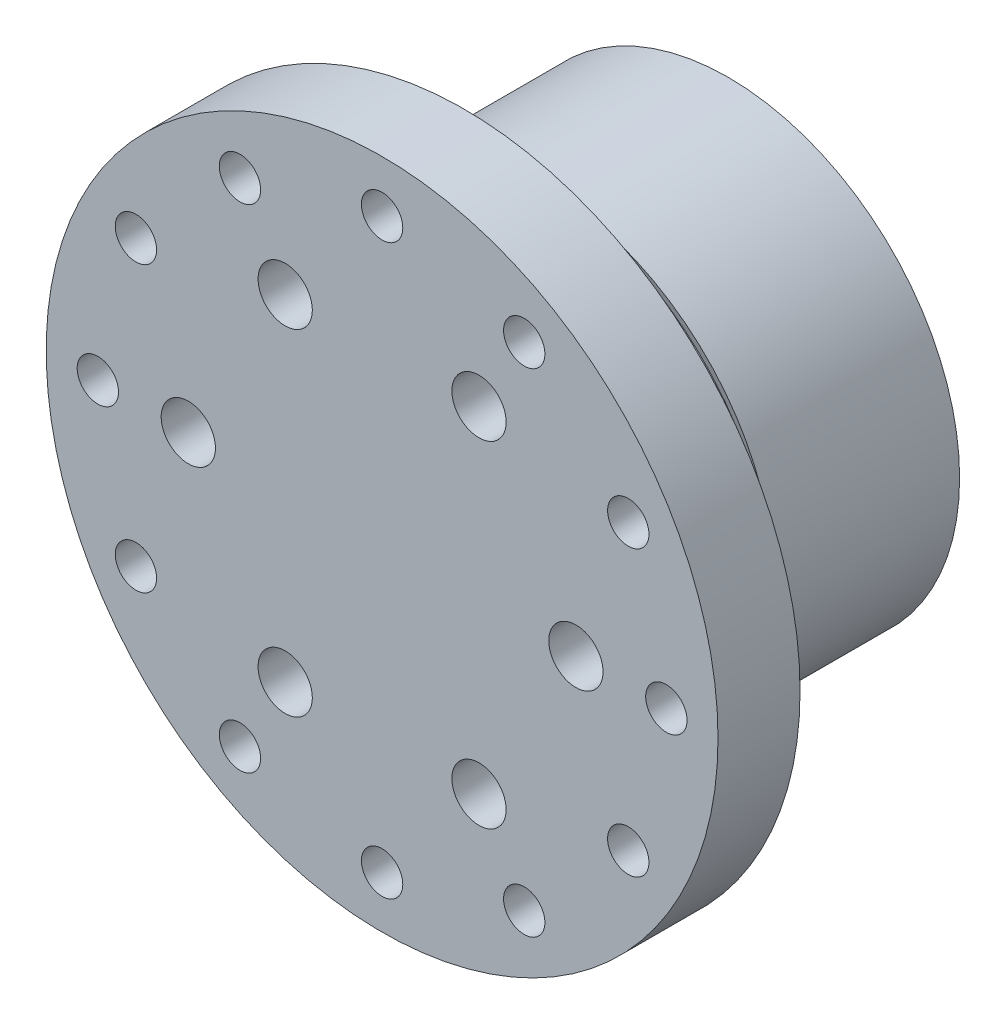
ISO-10303-21;
HEADER;
FILE_DESCRIPTION(('STEP AP214'),'2;1');
FILE_NAME('part.step','',(''),(''),'','','');
FILE_SCHEMA(('AUTOMOTIVE_DESIGN { 1 0 10303 214 1 1 1 1 }'));
ENDSEC;
DATA;
#1=APPLICATION_CONTEXT('core data for automotive mechanical design processes');
#2=APPLICATION_PROTOCOL_DEFINITION('international standard','automotive_design',2000,#1);
#3=PRODUCT_CONTEXT('',#1,'mechanical');
#4=PRODUCT('Part','Part','',(#3));
#5=PRODUCT_RELATED_PRODUCT_CATEGORY('part','',(#4));
#6=PRODUCT_DEFINITION_FORMATION('','',#4);
#7=PRODUCT_DEFINITION_CONTEXT('part definition',#1,'design');
#8=PRODUCT_DEFINITION('design','',#6,#7);
#9=PRODUCT_DEFINITION_SHAPE('','',#8);
#10=(LENGTH_UNIT() NAMED_UNIT(*) SI_UNIT(.MILLI.,.METRE.));
#11=(NAMED_UNIT(*) PLANE_ANGLE_UNIT() SI_UNIT($,.RADIAN.));
#12=(NAMED_UNIT(*) SI_UNIT($,.STERADIAN.) SOLID_ANGLE_UNIT());
#13=UNCERTAINTY_MEASURE_WITH_UNIT(LENGTH_MEASURE(1.E-05),#10,'distance_accuracy_value','');
#14=(GEOMETRIC_REPRESENTATION_CONTEXT(3) GLOBAL_UNCERTAINTY_ASSIGNED_CONTEXT((#13)) GLOBAL_UNIT_ASSIGNED_CONTEXT((#10,
#11,#12)) REPRESENTATION_CONTEXT('',''));
#15=CARTESIAN_POINT('',(0.,0.,0.));
#16=DIRECTION('',(0.,0.,1.));
#17=DIRECTION('',(1.,0.,0.));
#18=AXIS2_PLACEMENT_3D('',#15,#16,#17);
#19=CARTESIAN_POINT('',(0.,0.,0.));
#20=DIRECTION('',(0.,0.,1.));
#21=DIRECTION('',(1.,0.,0.));
#22=AXIS2_PLACEMENT_3D('',#19,#20,#21);
#23=PLANE('',#22);
#24=CARTESIAN_POINT('',(7.5,-12.9903810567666,0.));
#25=DIRECTION('',(0.,0.,1.));
#26=DIRECTION('',(1.,0.,0.));
#27=AXIS2_PLACEMENT_3D('',#24,#25,#26);
#28=CIRCLE('',#27,2.1);
#29=CARTESIAN_POINT('',(9.6,-12.9903810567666,0.));
#30=VERTEX_POINT('',#29);
#31=EDGE_CURVE('E152',#30,#30,#28,.T.);
#32=ORIENTED_EDGE('',*,*,#31,.T.);
#33=EDGE_LOOP('',(#32));
#34=FACE_BOUND('',#33,.T.);
#35=CARTESIAN_POINT('',(-7.5,-12.9903810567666,0.));
#36=DIRECTION('',(0.,0.,1.));
#37=DIRECTION('',(1.,0.,0.));
#38=AXIS2_PLACEMENT_3D('',#35,#36,#37);
#39=CIRCLE('',#38,2.1);
#40=CARTESIAN_POINT('',(-5.4,-12.9903810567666,0.));
#41=VERTEX_POINT('',#40);
#42=EDGE_CURVE('E162',#41,#41,#39,.T.);
#43=ORIENTED_EDGE('',*,*,#42,.T.);
#44=EDGE_LOOP('',(#43));
#45=FACE_BOUND('',#44,.T.);
#46=CARTESIAN_POINT('',(-15.,0.,0.));
#47=DIRECTION('',(0.,0.,1.));
#48=DIRECTION('',(1.,0.,0.));
#49=AXIS2_PLACEMENT_3D('',#46,#47,#48);
#50=CIRCLE('',#49,2.1);
#51=CARTESIAN_POINT('',(-12.9,0.,0.));
#52=VERTEX_POINT('',#51);
#53=EDGE_CURVE('E167',#52,#52,#50,.T.);
#54=ORIENTED_EDGE('',*,*,#53,.T.);
#55=EDGE_LOOP('',(#54));
#56=FACE_BOUND('',#55,.T.);
#57=CARTESIAN_POINT('',(-7.50000000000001,12.9903810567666,0.));
#58=DIRECTION('',(0.,0.,1.));
#59=DIRECTION('',(1.,0.,0.));
#60=AXIS2_PLACEMENT_3D('',#57,#58,#59);
#61=CIRCLE('',#60,2.1);
#62=CARTESIAN_POINT('',(-5.40000000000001,12.9903810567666,0.));
#63=VERTEX_POINT('',#62);
#64=EDGE_CURVE('E174',#63,#63,#61,.T.);
#65=ORIENTED_EDGE('',*,*,#64,.T.);
#66=EDGE_LOOP('',(#65));
#67=FACE_BOUND('',#66,.T.);
#68=CARTESIAN_POINT('',(7.5,12.9903810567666,0.));
#69=DIRECTION('',(0.,0.,1.));
#70=DIRECTION('',(1.,0.,0.));
#71=AXIS2_PLACEMENT_3D('',#68,#69,#70);
#72=CIRCLE('',#71,2.1);
#73=CARTESIAN_POINT('',(9.6,12.9903810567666,0.));
#74=VERTEX_POINT('',#73);
#75=EDGE_CURVE('E164',#74,#74,#72,.T.);
#76=ORIENTED_EDGE('',*,*,#75,.T.);
#77=EDGE_LOOP('',(#76));
#78=FACE_BOUND('',#77,.T.);
#79=CARTESIAN_POINT('',(15.,0.,0.));
#80=DIRECTION('',(0.,0.,1.));
#81=DIRECTION('',(1.,0.,0.));
#82=AXIS2_PLACEMENT_3D('',#79,#80,#81);
#83=CIRCLE('',#82,2.1);
#84=CARTESIAN_POINT('',(17.1,0.,0.));
#85=VERTEX_POINT('',#84);
#86=EDGE_CURVE('E149',#85,#85,#83,.T.);
#87=ORIENTED_EDGE('',*,*,#86,.T.);
#88=EDGE_LOOP('',(#87));
#89=FACE_BOUND('',#88,.T.);
#90=CARTESIAN_POINT('',(-12.3408620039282,-7.12500000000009,0.));
#91=DIRECTION('',(0.,0.,-1.));
#92=DIRECTION('',(-1.,0.,0.));
#93=AXIS2_PLACEMENT_3D('',#90,#91,#92);
#94=CIRCLE('',#93,3.);
#95=CARTESIAN_POINT('',(-15.3408620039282,-7.12500000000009,0.));
#96=VERTEX_POINT('',#95);
#97=EDGE_CURVE('E367',#96,#96,#94,.T.);
#98=ORIENTED_EDGE('',*,*,#97,.F.);
#99=EDGE_LOOP('',(#98));
#100=FACE_BOUND('',#99,.T.);
#101=CARTESIAN_POINT('',(0.,14.25,0.));
#102=DIRECTION('',(0.,0.,-1.));
#103=DIRECTION('',(-1.,0.,0.));
#104=AXIS2_PLACEMENT_3D('',#101,#102,#103);
#105=CIRCLE('',#104,3.);
#106=CARTESIAN_POINT('',(-3.00000000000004,14.25,0.));
#107=VERTEX_POINT('',#106);
#108=EDGE_CURVE('E382',#107,#107,#105,.T.);
#109=ORIENTED_EDGE('',*,*,#108,.F.);
#110=EDGE_LOOP('',(#109));
#111=FACE_BOUND('',#110,.T.);
#112=CARTESIAN_POINT('',(12.3408620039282,-7.12500000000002,0.));
#113=DIRECTION('',(0.,0.,-1.));
#114=DIRECTION('',(-1.,0.,0.));
#115=AXIS2_PLACEMENT_3D('',#112,#113,#114);
#116=CIRCLE('',#115,3.);
#117=CARTESIAN_POINT('',(9.34086200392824,-7.12500000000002,0.));
#118=VERTEX_POINT('',#117);
#119=EDGE_CURVE('E383',#118,#118,#116,.T.);
#120=ORIENTED_EDGE('',*,*,#119,.F.);
#121=EDGE_LOOP('',(#120));
#122=FACE_BOUND('',#121,.T.);
#123=CARTESIAN_POINT('',(0.,0.,0.));
#124=DIRECTION('',(0.,0.,-1.));
#125=DIRECTION('',(-1.,0.,0.));
#126=AXIS2_PLACEMENT_3D('',#123,#124,#125);
#127=CIRCLE('',#126,17.9);
#128=CARTESIAN_POINT('',(-17.9,0.,0.));
#129=VERTEX_POINT('',#128);
#130=EDGE_CURVE('E427',#129,#129,#127,.T.);
#131=ORIENTED_EDGE('',*,*,#130,.T.);
#132=EDGE_LOOP('',(#131));
#133=FACE_BOUND('',#132,.T.);
#134=ADVANCED_FACE('F48',(#34,#45,#56,#67,#78,#89,#100,#111,#122,#133),#23,.F.);
#135=CARTESIAN_POINT('',(0.,0.,20.45));
#136=DIRECTION('',(0.,0.,-1.));
#137=DIRECTION('',(-1.,0.,0.));
#138=AXIS2_PLACEMENT_3D('',#135,#136,#137);
#139=CYLINDRICAL_SURFACE('',#138,18.9);
#140=CARTESIAN_POINT('',(0.,0.,15.35));
#141=DIRECTION('',(0.,0.,1.));
#142=DIRECTION('',(1.,0.,0.));
#143=AXIS2_PLACEMENT_3D('',#140,#141,#142);
#144=CIRCLE('',#143,18.9);
#145=CARTESIAN_POINT('',(18.9,0.,15.35));
#146=VERTEX_POINT('',#145);
#147=EDGE_CURVE('E440',#146,#146,#144,.F.);
#148=ORIENTED_EDGE('',*,*,#147,.F.);
#149=EDGE_LOOP('',(#148));
#150=FACE_BOUND('',#149,.T.);
#151=CARTESIAN_POINT('',(0.,0.,20.45));
#152=DIRECTION('',(0.,0.,1.));
#153=DIRECTION('',(1.,0.,0.));
#154=AXIS2_PLACEMENT_3D('',#151,#152,#153);
#155=CIRCLE('',#154,18.9);
#156=CARTESIAN_POINT('',(18.9,0.,20.45));
#157=VERTEX_POINT('',#156);
#158=EDGE_CURVE('E60',#157,#157,#155,.T.);
#159=ORIENTED_EDGE('',*,*,#158,.F.);
#160=EDGE_LOOP('',(#159));
#161=FACE_BOUND('',#160,.T.);
#162=ADVANCED_FACE('F270',(#150,#161),#139,.T.);
#163=CARTESIAN_POINT('',(0.,0.,26.8));
#164=DIRECTION('',(0.,0.,-1.));
#165=DIRECTION('',(-1.,0.,0.));
#166=AXIS2_PLACEMENT_3D('',#163,#164,#165);
#167=CYLINDRICAL_SURFACE('',#166,26.);
#168=CARTESIAN_POINT('',(0.,0.,26.8));
#169=DIRECTION('',(0.,0.,1.));
#170=DIRECTION('',(1.,0.,0.));
#171=AXIS2_PLACEMENT_3D('',#168,#169,#170);
#172=CIRCLE('',#171,26.);
#173=CARTESIAN_POINT('',(26.,0.,26.8));
#174=VERTEX_POINT('',#173);
#175=EDGE_CURVE('E61',#174,#174,#172,.T.);
#176=ORIENTED_EDGE('',*,*,#175,.F.);
#177=EDGE_LOOP('',(#176));
#178=FACE_BOUND('',#177,.T.);
#179=CARTESIAN_POINT('',(0.,0.,20.45));
#180=DIRECTION('',(0.,0.,1.));
#181=DIRECTION('',(1.,0.,0.));
#182=AXIS2_PLACEMENT_3D('',#179,#180,#181);
#183=CIRCLE('',#182,26.);
#184=CARTESIAN_POINT('',(26.,0.,20.45));
#185=VERTEX_POINT('',#184);
#186=EDGE_CURVE('E70',#185,#185,#183,.T.);
#187=ORIENTED_EDGE('',*,*,#186,.T.);
#188=EDGE_LOOP('',(#187));
#189=FACE_BOUND('',#188,.T.);
#190=ADVANCED_FACE('F91',(#178,#189),#167,.T.);
#191=CARTESIAN_POINT('',(0.,0.,26.8));
#192=DIRECTION('',(0.,0.,1.));
#193=DIRECTION('',(1.,0.,0.));
#194=AXIS2_PLACEMENT_3D('',#191,#192,#193);
#195=PLANE('',#194);
#196=CARTESIAN_POINT('',(-10.9999999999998,19.0525588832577,26.8));
#197=DIRECTION('',(0.,0.,1.));
#198=DIRECTION('',(1.,0.,0.));
#199=AXIS2_PLACEMENT_3D('',#196,#197,#198);
#200=CIRCLE('',#199,1.6);
#201=CARTESIAN_POINT('',(-9.39999999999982,19.0525588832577,26.8));
#202=VERTEX_POINT('',#201);
#203=EDGE_CURVE('E408',#202,#202,#200,.T.);
#204=ORIENTED_EDGE('',*,*,#203,.F.);
#205=EDGE_LOOP('',(#204));
#206=FACE_BOUND('',#205,.T.);
#207=CARTESIAN_POINT('',(-19.0525588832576,11.0000000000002,26.8));
#208=DIRECTION('',(0.,0.,1.));
#209=DIRECTION('',(1.,0.,0.));
#210=AXIS2_PLACEMENT_3D('',#207,#208,#209);
#211=CIRCLE('',#210,1.6);
#212=CARTESIAN_POINT('',(-17.4525588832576,11.0000000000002,26.8));
#213=VERTEX_POINT('',#212);
#214=EDGE_CURVE('E415',#213,#213,#211,.T.);
#215=ORIENTED_EDGE('',*,*,#214,.F.);
#216=EDGE_LOOP('',(#215));
#217=FACE_BOUND('',#216,.T.);
#218=CARTESIAN_POINT('',(-22.,1.53625178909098E-13,26.8));
#219=DIRECTION('',(0.,0.,1.));
#220=DIRECTION('',(1.,0.,0.));
#221=AXIS2_PLACEMENT_3D('',#218,#219,#220);
#222=CIRCLE('',#221,1.6);
#223=CARTESIAN_POINT('',(-20.4,1.53625178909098E-13,26.8));
#224=VERTEX_POINT('',#223);
#225=EDGE_CURVE('E420',#224,#224,#222,.T.);
#226=ORIENTED_EDGE('',*,*,#225,.F.);
#227=EDGE_LOOP('',(#226));
#228=FACE_BOUND('',#227,.T.);
#229=CARTESIAN_POINT('',(-19.0525588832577,-10.9999999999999,26.8));
#230=DIRECTION('',(0.,0.,1.));
#231=DIRECTION('',(1.,0.,0.));
#232=AXIS2_PLACEMENT_3D('',#229,#230,#231);
#233=CIRCLE('',#232,1.6);
#234=CARTESIAN_POINT('',(-17.4525588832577,-10.9999999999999,26.8));
#235=VERTEX_POINT('',#234);
#236=EDGE_CURVE('E400',#235,#235,#233,.T.);
#237=ORIENTED_EDGE('',*,*,#236,.F.);
#238=EDGE_LOOP('',(#237));
#239=FACE_BOUND('',#238,.T.);
#240=CARTESIAN_POINT('',(-11.0000000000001,-19.0525588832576,26.8));
#241=DIRECTION('',(0.,0.,1.));
#242=DIRECTION('',(1.,0.,0.));
#243=AXIS2_PLACEMENT_3D('',#240,#241,#242);
#244=CIRCLE('',#243,1.6);
#245=CARTESIAN_POINT('',(-9.40000000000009,-19.0525588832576,26.8));
#246=VERTEX_POINT('',#245);
#247=EDGE_CURVE('E395',#246,#246,#244,.T.);
#248=ORIENTED_EDGE('',*,*,#247,.F.);
#249=EDGE_LOOP('',(#248));
#250=FACE_BOUND('',#249,.T.);
#251=CARTESIAN_POINT('',(0.,-22.,26.8));
#252=DIRECTION('',(0.,0.,1.));
#253=DIRECTION('',(1.,0.,0.));
#254=AXIS2_PLACEMENT_3D('',#251,#252,#253);
#255=CIRCLE('',#254,1.6);
#256=CARTESIAN_POINT('',(1.59999999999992,-22.,26.8));
#257=VERTEX_POINT('',#256);
#258=EDGE_CURVE('E399',#257,#257,#255,.T.);
#259=ORIENTED_EDGE('',*,*,#258,.F.);
#260=EDGE_LOOP('',(#259));
#261=FACE_BOUND('',#260,.T.);
#262=CARTESIAN_POINT('',(11.,-19.0525588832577,26.8));
#263=DIRECTION('',(0.,0.,1.));
#264=DIRECTION('',(1.,0.,0.));
#265=AXIS2_PLACEMENT_3D('',#262,#263,#264);
#266=CIRCLE('',#265,1.6);
#267=CARTESIAN_POINT('',(12.6,-19.0525588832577,26.8));
#268=VERTEX_POINT('',#267);
#269=EDGE_CURVE('E405',#268,#268,#266,.T.);
#270=ORIENTED_EDGE('',*,*,#269,.F.);
#271=EDGE_LOOP('',(#270));
#272=FACE_BOUND('',#271,.T.);
#273=CARTESIAN_POINT('',(19.0525588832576,-11.,26.8));
#274=DIRECTION('',(0.,0.,1.));
#275=DIRECTION('',(1.,0.,0.));
#276=AXIS2_PLACEMENT_3D('',#273,#274,#275);
#277=CIRCLE('',#276,1.6);
#278=CARTESIAN_POINT('',(20.6525588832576,-11.,26.8));
#279=VERTEX_POINT('',#278);
#280=EDGE_CURVE('E342',#279,#279,#277,.T.);
#281=ORIENTED_EDGE('',*,*,#280,.F.);
#282=EDGE_LOOP('',(#281));
#283=FACE_BOUND('',#282,.T.);
#284=CARTESIAN_POINT('',(2.30437768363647E-13,22.,26.8));
#285=DIRECTION('',(0.,0.,1.));
#286=DIRECTION('',(1.,0.,0.));
#287=AXIS2_PLACEMENT_3D('',#284,#285,#286);
#288=CIRCLE('',#287,1.6);
#289=CARTESIAN_POINT('',(1.60000000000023,22.,26.8));
#290=VERTEX_POINT('',#289);
#291=EDGE_CURVE('E411',#290,#290,#288,.T.);
#292=ORIENTED_EDGE('',*,*,#291,.F.);
#293=EDGE_LOOP('',(#292));
#294=FACE_BOUND('',#293,.T.);
#295=CARTESIAN_POINT('',(11.0000000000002,19.0525588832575,26.8));
#296=DIRECTION('',(0.,0.,1.));
#297=DIRECTION('',(1.,0.,0.));
#298=AXIS2_PLACEMENT_3D('',#295,#296,#297);
#299=CIRCLE('',#298,1.6);
#300=CARTESIAN_POINT('',(12.6000000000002,19.0525588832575,26.8));
#301=VERTEX_POINT('',#300);
#302=EDGE_CURVE('E429',#301,#301,#299,.T.);
#303=ORIENTED_EDGE('',*,*,#302,.F.);
#304=EDGE_LOOP('',(#303));
#305=FACE_BOUND('',#304,.T.);
#306=CARTESIAN_POINT('',(19.0525588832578,10.9999999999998,26.8));
#307=DIRECTION('',(0.,0.,1.));
#308=DIRECTION('',(1.,0.,0.));
#309=AXIS2_PLACEMENT_3D('',#306,#307,#308);
#310=CIRCLE('',#309,1.6);
#311=CARTESIAN_POINT('',(20.6525588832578,10.9999999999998,26.8));
#312=VERTEX_POINT('',#311);
#313=EDGE_CURVE('E424',#312,#312,#310,.T.);
#314=ORIENTED_EDGE('',*,*,#313,.F.);
#315=EDGE_LOOP('',(#314));
#316=FACE_BOUND('',#315,.T.);
#317=CARTESIAN_POINT('',(22.,0.,26.8));
#318=DIRECTION('',(0.,0.,1.));
#319=DIRECTION('',(1.,0.,0.));
#320=AXIS2_PLACEMENT_3D('',#317,#318,#319);
#321=CIRCLE('',#320,1.6);
#322=CARTESIAN_POINT('',(23.6,0.,26.8));
#323=VERTEX_POINT('',#322);
#324=EDGE_CURVE('E338',#323,#323,#321,.T.);
#325=ORIENTED_EDGE('',*,*,#324,.F.);
#326=EDGE_LOOP('',(#325));
#327=FACE_BOUND('',#326,.T.);
#328=CARTESIAN_POINT('',(15.,0.,26.800012));
#329=DIRECTION('',(0.,0.,1.));
#330=DIRECTION('',(1.,0.,0.));
#331=AXIS2_PLACEMENT_3D('',#328,#329,#330);
#332=CIRCLE('',#331,2.1);
#333=CARTESIAN_POINT('',(17.1,0.,26.800012));
#334=VERTEX_POINT('',#333);
#335=EDGE_CURVE('E145',#334,#334,#332,.T.);
#336=ORIENTED_EDGE('',*,*,#335,.F.);
#337=EDGE_LOOP('',(#336));
#338=FACE_BOUND('',#337,.T.);
#339=CARTESIAN_POINT('',(7.5,12.9903810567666,26.800012));
#340=DIRECTION('',(0.,0.,1.));
#341=DIRECTION('',(1.,0.,0.));
#342=AXIS2_PLACEMENT_3D('',#339,#340,#341);
#343=CIRCLE('',#342,2.1);
#344=CARTESIAN_POINT('',(9.6,12.9903810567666,26.800012));
#345=VERTEX_POINT('',#344);
#346=EDGE_CURVE('E132',#345,#345,#343,.T.);
#347=ORIENTED_EDGE('',*,*,#346,.F.);
#348=EDGE_LOOP('',(#347));
#349=FACE_BOUND('',#348,.T.);
#350=CARTESIAN_POINT('',(-7.50000000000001,12.9903810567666,26.800012));
#351=DIRECTION('',(0.,0.,1.));
#352=DIRECTION('',(1.,0.,0.));
#353=AXIS2_PLACEMENT_3D('',#350,#351,#352);
#354=CIRCLE('',#353,2.1);
#355=CARTESIAN_POINT('',(-5.40000000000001,12.9903810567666,26.800012));
#356=VERTEX_POINT('',#355);
#357=EDGE_CURVE('E172',#356,#356,#354,.T.);
#358=ORIENTED_EDGE('',*,*,#357,.F.);
#359=EDGE_LOOP('',(#358));
#360=FACE_BOUND('',#359,.T.);
#361=CARTESIAN_POINT('',(-15.,0.,26.800012));
#362=DIRECTION('',(0.,0.,1.));
#363=DIRECTION('',(1.,0.,0.));
#364=AXIS2_PLACEMENT_3D('',#361,#362,#363);
#365=CIRCLE('',#364,2.1);
#366=CARTESIAN_POINT('',(-12.9,0.,26.800012));
#367=VERTEX_POINT('',#366);
#368=EDGE_CURVE('E169',#367,#367,#365,.T.);
#369=ORIENTED_EDGE('',*,*,#368,.F.);
#370=EDGE_LOOP('',(#369));
#371=FACE_BOUND('',#370,.T.);
#372=CARTESIAN_POINT('',(-7.5,-12.9903810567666,26.800012));
#373=DIRECTION('',(0.,0.,1.));
#374=DIRECTION('',(1.,0.,0.));
#375=AXIS2_PLACEMENT_3D('',#372,#373,#374);
#376=CIRCLE('',#375,2.1);
#377=CARTESIAN_POINT('',(-5.4,-12.9903810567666,26.800012));
#378=VERTEX_POINT('',#377);
#379=EDGE_CURVE('E157',#378,#378,#376,.T.);
#380=ORIENTED_EDGE('',*,*,#379,.F.);
#381=EDGE_LOOP('',(#380));
#382=FACE_BOUND('',#381,.T.);
#383=CARTESIAN_POINT('',(7.5,-12.9903810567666,26.800012));
#384=DIRECTION('',(0.,0.,1.));
#385=DIRECTION('',(1.,0.,0.));
#386=AXIS2_PLACEMENT_3D('',#383,#384,#385);
#387=CIRCLE('',#386,2.1);
#388=CARTESIAN_POINT('',(9.6,-12.9903810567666,26.800012));
#389=VERTEX_POINT('',#388);
#390=EDGE_CURVE('E77',#389,#389,#387,.T.);
#391=ORIENTED_EDGE('',*,*,#390,.F.);
#392=EDGE_LOOP('',(#391));
#393=FACE_BOUND('',#392,.T.);
#394=ORIENTED_EDGE('',*,*,#175,.T.);
#395=EDGE_LOOP('',(#394));
#396=FACE_BOUND('',#395,.T.);
#397=ADVANCED_FACE('F85',(#206,#217,#228,#239,#250,#261,#272,#283,#294,#305,#316,#327,#338,#349,
#360,#371,#382,#393,#396),#195,.T.);
#398=CARTESIAN_POINT('',(0.,0.,20.45));
#399=DIRECTION('',(0.,0.,1.));
#400=DIRECTION('',(1.,0.,0.));
#401=AXIS2_PLACEMENT_3D('',#398,#399,#400);
#402=PLANE('',#401);
#403=CARTESIAN_POINT('',(-10.9999999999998,19.0525588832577,20.45));
#404=DIRECTION('',(0.,0.,1.));
#405=DIRECTION('',(1.,0.,0.));
#406=AXIS2_PLACEMENT_3D('',#403,#404,#405);
#407=CIRCLE('',#406,1.6);
#408=CARTESIAN_POINT('',(-9.39999999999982,19.0525588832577,20.45));
#409=VERTEX_POINT('',#408);
#410=EDGE_CURVE('E295',#409,#409,#407,.T.);
#411=ORIENTED_EDGE('',*,*,#410,.T.);
#412=EDGE_LOOP('',(#411));
#413=FACE_BOUND('',#412,.T.);
#414=CARTESIAN_POINT('',(-19.0525588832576,11.0000000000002,20.45));
#415=DIRECTION('',(0.,0.,1.));
#416=DIRECTION('',(1.,0.,0.));
#417=AXIS2_PLACEMENT_3D('',#414,#415,#416);
#418=CIRCLE('',#417,1.6);
#419=CARTESIAN_POINT('',(-17.4525588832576,11.0000000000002,20.45));
#420=VERTEX_POINT('',#419);
#421=EDGE_CURVE('E296',#420,#420,#418,.T.);
#422=ORIENTED_EDGE('',*,*,#421,.T.);
#423=EDGE_LOOP('',(#422));
#424=FACE_BOUND('',#423,.T.);
#425=CARTESIAN_POINT('',(-22.,1.53625178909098E-13,20.45));
#426=DIRECTION('',(0.,0.,1.));
#427=DIRECTION('',(1.,0.,0.));
#428=AXIS2_PLACEMENT_3D('',#425,#426,#427);
#429=CIRCLE('',#428,1.6);
#430=CARTESIAN_POINT('',(-20.4,1.53625178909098E-13,20.45));
#431=VERTEX_POINT('',#430);
#432=EDGE_CURVE('E305',#431,#431,#429,.T.);
#433=ORIENTED_EDGE('',*,*,#432,.T.);
#434=EDGE_LOOP('',(#433));
#435=FACE_BOUND('',#434,.T.);
#436=CARTESIAN_POINT('',(-19.0525588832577,-10.9999999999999,20.45));
#437=DIRECTION('',(0.,0.,1.));
#438=DIRECTION('',(1.,0.,0.));
#439=AXIS2_PLACEMENT_3D('',#436,#437,#438);
#440=CIRCLE('',#439,1.6);
#441=CARTESIAN_POINT('',(-17.4525588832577,-10.9999999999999,20.45));
#442=VERTEX_POINT('',#441);
#443=EDGE_CURVE('E306',#442,#442,#440,.T.);
#444=ORIENTED_EDGE('',*,*,#443,.T.);
#445=EDGE_LOOP('',(#444));
#446=FACE_BOUND('',#445,.T.);
#447=CARTESIAN_POINT('',(-11.0000000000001,-19.0525588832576,20.45));
#448=DIRECTION('',(0.,0.,1.));
#449=DIRECTION('',(1.,0.,0.));
#450=AXIS2_PLACEMENT_3D('',#447,#448,#449);
#451=CIRCLE('',#450,1.6);
#452=CARTESIAN_POINT('',(-9.40000000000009,-19.0525588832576,20.45));
#453=VERTEX_POINT('',#452);
#454=EDGE_CURVE('E309',#453,#453,#451,.T.);
#455=ORIENTED_EDGE('',*,*,#454,.T.);
#456=EDGE_LOOP('',(#455));
#457=FACE_BOUND('',#456,.T.);
#458=CARTESIAN_POINT('',(0.,-22.,20.45));
#459=DIRECTION('',(0.,0.,1.));
#460=DIRECTION('',(1.,0.,0.));
#461=AXIS2_PLACEMENT_3D('',#458,#459,#460);
#462=CIRCLE('',#461,1.6);
#463=CARTESIAN_POINT('',(1.59999999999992,-22.,20.45));
#464=VERTEX_POINT('',#463);
#465=EDGE_CURVE('E313',#464,#464,#462,.T.);
#466=ORIENTED_EDGE('',*,*,#465,.T.);
#467=EDGE_LOOP('',(#466));
#468=FACE_BOUND('',#467,.T.);
#469=CARTESIAN_POINT('',(11.,-19.0525588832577,20.45));
#470=DIRECTION('',(0.,0.,1.));
#471=DIRECTION('',(1.,0.,0.));
#472=AXIS2_PLACEMENT_3D('',#469,#470,#471);
#473=CIRCLE('',#472,1.6);
#474=CARTESIAN_POINT('',(12.6,-19.0525588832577,20.45));
#475=VERTEX_POINT('',#474);
#476=EDGE_CURVE('E319',#475,#475,#473,.T.);
#477=ORIENTED_EDGE('',*,*,#476,.T.);
#478=EDGE_LOOP('',(#477));
#479=FACE_BOUND('',#478,.T.);
#480=CARTESIAN_POINT('',(19.0525588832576,-11.,20.45));
#481=DIRECTION('',(0.,0.,1.));
#482=DIRECTION('',(1.,0.,0.));
#483=AXIS2_PLACEMENT_3D('',#480,#481,#482);
#484=CIRCLE('',#483,1.6);
#485=CARTESIAN_POINT('',(20.6525588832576,-11.,20.45));
#486=VERTEX_POINT('',#485);
#487=EDGE_CURVE('E321',#486,#486,#484,.T.);
#488=ORIENTED_EDGE('',*,*,#487,.T.);
#489=EDGE_LOOP('',(#488));
#490=FACE_BOUND('',#489,.T.);
#491=CARTESIAN_POINT('',(2.30437768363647E-13,22.,20.45));
#492=DIRECTION('',(0.,0.,1.));
#493=DIRECTION('',(1.,0.,0.));
#494=AXIS2_PLACEMENT_3D('',#491,#492,#493);
#495=CIRCLE('',#494,1.6);
#496=CARTESIAN_POINT('',(1.60000000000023,22.,20.45));
#497=VERTEX_POINT('',#496);
#498=EDGE_CURVE('E327',#497,#497,#495,.T.);
#499=ORIENTED_EDGE('',*,*,#498,.T.);
#500=EDGE_LOOP('',(#499));
#501=FACE_BOUND('',#500,.T.);
#502=CARTESIAN_POINT('',(11.0000000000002,19.0525588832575,20.45));
#503=DIRECTION('',(0.,0.,1.));
#504=DIRECTION('',(1.,0.,0.));
#505=AXIS2_PLACEMENT_3D('',#502,#503,#504);
#506=CIRCLE('',#505,1.6);
#507=CARTESIAN_POINT('',(12.6000000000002,19.0525588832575,20.45));
#508=VERTEX_POINT('',#507);
#509=EDGE_CURVE('E328',#508,#508,#506,.T.);
#510=ORIENTED_EDGE('',*,*,#509,.T.);
#511=EDGE_LOOP('',(#510));
#512=FACE_BOUND('',#511,.T.);
#513=CARTESIAN_POINT('',(19.0525588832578,10.9999999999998,20.45));
#514=DIRECTION('',(0.,0.,1.));
#515=DIRECTION('',(1.,0.,0.));
#516=AXIS2_PLACEMENT_3D('',#513,#514,#515);
#517=CIRCLE('',#516,1.6);
#518=CARTESIAN_POINT('',(20.6525588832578,10.9999999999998,20.45));
#519=VERTEX_POINT('',#518);
#520=EDGE_CURVE('E331',#519,#519,#517,.T.);
#521=ORIENTED_EDGE('',*,*,#520,.T.);
#522=EDGE_LOOP('',(#521));
#523=FACE_BOUND('',#522,.T.);
#524=CARTESIAN_POINT('',(22.,0.,20.45));
#525=DIRECTION('',(0.,0.,1.));
#526=DIRECTION('',(1.,0.,0.));
#527=AXIS2_PLACEMENT_3D('',#524,#525,#526);
#528=CIRCLE('',#527,1.6);
#529=CARTESIAN_POINT('',(23.6,0.,20.45));
#530=VERTEX_POINT('',#529);
#531=EDGE_CURVE('E340',#530,#530,#528,.T.);
#532=ORIENTED_EDGE('',*,*,#531,.T.);
#533=EDGE_LOOP('',(#532));
#534=FACE_BOUND('',#533,.T.);
#535=ORIENTED_EDGE('',*,*,#158,.T.);
#536=EDGE_LOOP('',(#535));
#537=FACE_BOUND('',#536,.T.);
#538=ORIENTED_EDGE('',*,*,#186,.F.);
#539=EDGE_LOOP('',(#538));
#540=FACE_BOUND('',#539,.T.);
#541=ADVANCED_FACE('F95',(#413,#424,#435,#446,#457,#468,#479,#490,#501,#512,#523,#534,#537,
#540),#402,.F.);
#542=CARTESIAN_POINT('',(7.5,-12.9903810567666,0.));
#543=DIRECTION('',(0.,0.,1.));
#544=DIRECTION('',(1.,0.,0.));
#545=AXIS2_PLACEMENT_3D('',#542,#543,#544);
#546=CYLINDRICAL_SURFACE('',#545,2.1);
#547=ORIENTED_EDGE('',*,*,#31,.F.);
#548=EDGE_LOOP('',(#547));
#549=FACE_BOUND('',#548,.T.);
#550=ORIENTED_EDGE('',*,*,#390,.T.);
#551=EDGE_LOOP('',(#550));
#552=FACE_BOUND('',#551,.T.);
#553=ADVANCED_FACE('F205',(#549,#552),#546,.F.);
#554=CARTESIAN_POINT('',(-7.5,-12.9903810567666,0.));
#555=DIRECTION('',(0.,0.,1.));
#556=DIRECTION('',(1.,0.,0.));
#557=AXIS2_PLACEMENT_3D('',#554,#555,#556);
#558=CYLINDRICAL_SURFACE('',#557,2.1);
#559=ORIENTED_EDGE('',*,*,#42,.F.);
#560=EDGE_LOOP('',(#559));
#561=FACE_BOUND('',#560,.T.);
#562=ORIENTED_EDGE('',*,*,#379,.T.);
#563=EDGE_LOOP('',(#562));
#564=FACE_BOUND('',#563,.T.);
#565=ADVANCED_FACE('F241',(#561,#564),#558,.F.);
#566=CARTESIAN_POINT('',(-15.,0.,0.));
#567=DIRECTION('',(0.,0.,1.));
#568=DIRECTION('',(1.,0.,0.));
#569=AXIS2_PLACEMENT_3D('',#566,#567,#568);
#570=CYLINDRICAL_SURFACE('',#569,2.1);
#571=ORIENTED_EDGE('',*,*,#53,.F.);
#572=EDGE_LOOP('',(#571));
#573=FACE_BOUND('',#572,.T.);
#574=ORIENTED_EDGE('',*,*,#368,.T.);
#575=EDGE_LOOP('',(#574));
#576=FACE_BOUND('',#575,.T.);
#577=ADVANCED_FACE('F231',(#573,#576),#570,.F.);
#578=CARTESIAN_POINT('',(-7.50000000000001,12.9903810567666,0.));
#579=DIRECTION('',(0.,0.,1.));
#580=DIRECTION('',(1.,0.,0.));
#581=AXIS2_PLACEMENT_3D('',#578,#579,#580);
#582=CYLINDRICAL_SURFACE('',#581,2.1);
#583=ORIENTED_EDGE('',*,*,#64,.F.);
#584=EDGE_LOOP('',(#583));
#585=FACE_BOUND('',#584,.T.);
#586=ORIENTED_EDGE('',*,*,#357,.T.);
#587=EDGE_LOOP('',(#586));
#588=FACE_BOUND('',#587,.T.);
#589=ADVANCED_FACE('F98',(#585,#588),#582,.F.);
#590=CARTESIAN_POINT('',(7.5,12.9903810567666,0.));
#591=DIRECTION('',(0.,0.,1.));
#592=DIRECTION('',(1.,0.,0.));
#593=AXIS2_PLACEMENT_3D('',#590,#591,#592);
#594=CYLINDRICAL_SURFACE('',#593,2.1);
#595=ORIENTED_EDGE('',*,*,#75,.F.);
#596=EDGE_LOOP('',(#595));
#597=FACE_BOUND('',#596,.T.);
#598=ORIENTED_EDGE('',*,*,#346,.T.);
#599=EDGE_LOOP('',(#598));
#600=FACE_BOUND('',#599,.T.);
#601=ADVANCED_FACE('F192',(#597,#600),#594,.F.);
#602=CARTESIAN_POINT('',(15.,0.,0.));
#603=DIRECTION('',(0.,0.,1.));
#604=DIRECTION('',(1.,0.,0.));
#605=AXIS2_PLACEMENT_3D('',#602,#603,#604);
#606=CYLINDRICAL_SURFACE('',#605,2.1);
#607=ORIENTED_EDGE('',*,*,#86,.F.);
#608=EDGE_LOOP('',(#607));
#609=FACE_BOUND('',#608,.T.);
#610=ORIENTED_EDGE('',*,*,#335,.T.);
#611=EDGE_LOOP('',(#610));
#612=FACE_BOUND('',#611,.T.);
#613=ADVANCED_FACE('F183',(#609,#612),#606,.F.);
#614=CARTESIAN_POINT('',(-12.3408620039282,-7.12500000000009,4.));
#615=DIRECTION('',(0.,0.,-1.));
#616=DIRECTION('',(-1.,0.,0.));
#617=AXIS2_PLACEMENT_3D('',#614,#615,#616);
#618=CYLINDRICAL_SURFACE('',#617,3.);
#619=CARTESIAN_POINT('',(-12.3408620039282,-7.12500000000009,4.));
#620=DIRECTION('',(0.,0.,-1.));
#621=DIRECTION('',(-1.,0.,0.));
#622=AXIS2_PLACEMENT_3D('',#619,#620,#621);
#623=CIRCLE('',#622,3.);
#624=CARTESIAN_POINT('',(-15.3408620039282,-7.12500000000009,4.));
#625=VERTEX_POINT('',#624);
#626=EDGE_CURVE('E366',#625,#625,#623,.T.);
#627=ORIENTED_EDGE('',*,*,#626,.F.);
#628=EDGE_LOOP('',(#627));
#629=FACE_BOUND('',#628,.T.);
#630=ORIENTED_EDGE('',*,*,#97,.T.);
#631=EDGE_LOOP('',(#630));
#632=FACE_BOUND('',#631,.T.);
#633=ADVANCED_FACE('F193',(#629,#632),#618,.F.);
#634=CARTESIAN_POINT('',(-12.3408620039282,-7.12500000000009,4.));
#635=DIRECTION('',(0.,0.,-1.));
#636=DIRECTION('',(-1.,0.,0.));
#637=AXIS2_PLACEMENT_3D('',#634,#635,#636);
#638=PLANE('',#637);
#639=ORIENTED_EDGE('',*,*,#626,.T.);
#640=EDGE_LOOP('',(#639));
#641=FACE_BOUND('',#640,.T.);
#642=ADVANCED_FACE('F199',(#641),#638,.T.);
#643=CARTESIAN_POINT('',(0.,14.25,4.));
#644=DIRECTION('',(0.,0.,-1.));
#645=DIRECTION('',(-1.,0.,0.));
#646=AXIS2_PLACEMENT_3D('',#643,#644,#645);
#647=CYLINDRICAL_SURFACE('',#646,3.);
#648=CARTESIAN_POINT('',(0.,14.25,4.));
#649=DIRECTION('',(0.,0.,-1.));
#650=DIRECTION('',(-1.,0.,0.));
#651=AXIS2_PLACEMENT_3D('',#648,#649,#650);
#652=CIRCLE('',#651,3.);
#653=CARTESIAN_POINT('',(-3.00000000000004,14.25,4.));
#654=VERTEX_POINT('',#653);
#655=EDGE_CURVE('E374',#654,#654,#652,.T.);
#656=ORIENTED_EDGE('',*,*,#655,.F.);
#657=EDGE_LOOP('',(#656));
#658=FACE_BOUND('',#657,.T.);
#659=ORIENTED_EDGE('',*,*,#108,.T.);
#660=EDGE_LOOP('',(#659));
#661=FACE_BOUND('',#660,.T.);
#662=ADVANCED_FACE('F508',(#658,#661),#647,.F.);
#663=CARTESIAN_POINT('',(0.,14.25,4.));
#664=DIRECTION('',(0.,0.,-1.));
#665=DIRECTION('',(-1.,0.,0.));
#666=AXIS2_PLACEMENT_3D('',#663,#664,#665);
#667=PLANE('',#666);
#668=ORIENTED_EDGE('',*,*,#655,.T.);
#669=EDGE_LOOP('',(#668));
#670=FACE_BOUND('',#669,.T.);
#671=ADVANCED_FACE('F510',(#670),#667,.T.);
#672=CARTESIAN_POINT('',(12.3408620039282,-7.12500000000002,4.));
#673=DIRECTION('',(0.,0.,-1.));
#674=DIRECTION('',(-1.,0.,0.));
#675=AXIS2_PLACEMENT_3D('',#672,#673,#674);
#676=CYLINDRICAL_SURFACE('',#675,3.);
#677=CARTESIAN_POINT('',(12.3408620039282,-7.12500000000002,4.));
#678=DIRECTION('',(0.,0.,-1.));
#679=DIRECTION('',(-1.,0.,0.));
#680=AXIS2_PLACEMENT_3D('',#677,#678,#679);
#681=CIRCLE('',#680,3.);
#682=CARTESIAN_POINT('',(9.34086200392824,-7.12500000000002,4.));
#683=VERTEX_POINT('',#682);
#684=EDGE_CURVE('E388',#683,#683,#681,.T.);
#685=ORIENTED_EDGE('',*,*,#684,.F.);
#686=EDGE_LOOP('',(#685));
#687=FACE_BOUND('',#686,.T.);
#688=ORIENTED_EDGE('',*,*,#119,.T.);
#689=EDGE_LOOP('',(#688));
#690=FACE_BOUND('',#689,.T.);
#691=ADVANCED_FACE('F503',(#687,#690),#676,.F.);
#692=CARTESIAN_POINT('',(12.3408620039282,-7.12500000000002,4.));
#693=DIRECTION('',(0.,0.,-1.));
#694=DIRECTION('',(-1.,0.,0.));
#695=AXIS2_PLACEMENT_3D('',#692,#693,#694);
#696=PLANE('',#695);
#697=ORIENTED_EDGE('',*,*,#684,.T.);
#698=EDGE_LOOP('',(#697));
#699=FACE_BOUND('',#698,.T.);
#700=ADVANCED_FACE('F497',(#699),#696,.T.);
#701=CARTESIAN_POINT('',(22.,0.,0.));
#702=DIRECTION('',(0.,0.,1.));
#703=DIRECTION('',(1.,0.,0.));
#704=AXIS2_PLACEMENT_3D('',#701,#702,#703);
#705=CYLINDRICAL_SURFACE('',#704,1.6);
#706=ORIENTED_EDGE('',*,*,#324,.T.);
#707=EDGE_LOOP('',(#706));
#708=FACE_BOUND('',#707,.T.);
#709=ORIENTED_EDGE('',*,*,#531,.F.);
#710=EDGE_LOOP('',(#709));
#711=FACE_BOUND('',#710,.T.);
#712=ADVANCED_FACE('F468',(#708,#711),#705,.F.);
#713=CARTESIAN_POINT('',(19.0525588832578,10.9999999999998,0.));
#714=DIRECTION('',(0.,0.,1.));
#715=DIRECTION('',(1.,0.,0.));
#716=AXIS2_PLACEMENT_3D('',#713,#714,#715);
#717=CYLINDRICAL_SURFACE('',#716,1.6);
#718=ORIENTED_EDGE('',*,*,#313,.T.);
#719=EDGE_LOOP('',(#718));
#720=FACE_BOUND('',#719,.T.);
#721=ORIENTED_EDGE('',*,*,#520,.F.);
#722=EDGE_LOOP('',(#721));
#723=FACE_BOUND('',#722,.T.);
#724=ADVANCED_FACE('F467',(#720,#723),#717,.F.);
#725=CARTESIAN_POINT('',(11.0000000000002,19.0525588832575,0.));
#726=DIRECTION('',(0.,0.,1.));
#727=DIRECTION('',(1.,0.,0.));
#728=AXIS2_PLACEMENT_3D('',#725,#726,#727);
#729=CYLINDRICAL_SURFACE('',#728,1.6);
#730=ORIENTED_EDGE('',*,*,#302,.T.);
#731=EDGE_LOOP('',(#730));
#732=FACE_BOUND('',#731,.T.);
#733=ORIENTED_EDGE('',*,*,#509,.F.);
#734=EDGE_LOOP('',(#733));
#735=FACE_BOUND('',#734,.T.);
#736=ADVANCED_FACE('F464',(#732,#735),#729,.F.);
#737=CARTESIAN_POINT('',(2.30437768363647E-13,22.,0.));
#738=DIRECTION('',(0.,0.,1.));
#739=DIRECTION('',(1.,0.,0.));
#740=AXIS2_PLACEMENT_3D('',#737,#738,#739);
#741=CYLINDRICAL_SURFACE('',#740,1.6);
#742=ORIENTED_EDGE('',*,*,#291,.T.);
#743=EDGE_LOOP('',(#742));
#744=FACE_BOUND('',#743,.T.);
#745=ORIENTED_EDGE('',*,*,#498,.F.);
#746=EDGE_LOOP('',(#745));
#747=FACE_BOUND('',#746,.T.);
#748=ADVANCED_FACE('F460',(#744,#747),#741,.F.);
#749=CARTESIAN_POINT('',(19.0525588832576,-11.,0.));
#750=DIRECTION('',(0.,0.,1.));
#751=DIRECTION('',(1.,0.,0.));
#752=AXIS2_PLACEMENT_3D('',#749,#750,#751);
#753=CYLINDRICAL_SURFACE('',#752,1.6);
#754=ORIENTED_EDGE('',*,*,#280,.T.);
#755=EDGE_LOOP('',(#754));
#756=FACE_BOUND('',#755,.T.);
#757=ORIENTED_EDGE('',*,*,#487,.F.);
#758=EDGE_LOOP('',(#757));
#759=FACE_BOUND('',#758,.T.);
#760=ADVANCED_FACE('F462',(#756,#759),#753,.F.);
#761=CARTESIAN_POINT('',(11.,-19.0525588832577,0.));
#762=DIRECTION('',(0.,0.,1.));
#763=DIRECTION('',(1.,0.,0.));
#764=AXIS2_PLACEMENT_3D('',#761,#762,#763);
#765=CYLINDRICAL_SURFACE('',#764,1.6);
#766=ORIENTED_EDGE('',*,*,#269,.T.);
#767=EDGE_LOOP('',(#766));
#768=FACE_BOUND('',#767,.T.);
#769=ORIENTED_EDGE('',*,*,#476,.F.);
#770=EDGE_LOOP('',(#769));
#771=FACE_BOUND('',#770,.T.);
#772=ADVANCED_FACE('F488',(#768,#771),#765,.F.);
#773=CARTESIAN_POINT('',(0.,-22.,0.));
#774=DIRECTION('',(0.,0.,1.));
#775=DIRECTION('',(1.,0.,0.));
#776=AXIS2_PLACEMENT_3D('',#773,#774,#775);
#777=CYLINDRICAL_SURFACE('',#776,1.6);
#778=ORIENTED_EDGE('',*,*,#258,.T.);
#779=EDGE_LOOP('',(#778));
#780=FACE_BOUND('',#779,.T.);
#781=ORIENTED_EDGE('',*,*,#465,.F.);
#782=EDGE_LOOP('',(#781));
#783=FACE_BOUND('',#782,.T.);
#784=ADVANCED_FACE('F489',(#780,#783),#777,.F.);
#785=CARTESIAN_POINT('',(-11.0000000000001,-19.0525588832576,0.));
#786=DIRECTION('',(0.,0.,1.));
#787=DIRECTION('',(1.,0.,0.));
#788=AXIS2_PLACEMENT_3D('',#785,#786,#787);
#789=CYLINDRICAL_SURFACE('',#788,1.6);
#790=ORIENTED_EDGE('',*,*,#247,.T.);
#791=EDGE_LOOP('',(#790));
#792=FACE_BOUND('',#791,.T.);
#793=ORIENTED_EDGE('',*,*,#454,.F.);
#794=EDGE_LOOP('',(#793));
#795=FACE_BOUND('',#794,.T.);
#796=ADVANCED_FACE('F477',(#792,#795),#789,.F.);
#797=CARTESIAN_POINT('',(-19.0525588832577,-10.9999999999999,0.));
#798=DIRECTION('',(0.,0.,1.));
#799=DIRECTION('',(1.,0.,0.));
#800=AXIS2_PLACEMENT_3D('',#797,#798,#799);
#801=CYLINDRICAL_SURFACE('',#800,1.6);
#802=ORIENTED_EDGE('',*,*,#236,.T.);
#803=EDGE_LOOP('',(#802));
#804=FACE_BOUND('',#803,.T.);
#805=ORIENTED_EDGE('',*,*,#443,.F.);
#806=EDGE_LOOP('',(#805));
#807=FACE_BOUND('',#806,.T.);
#808=ADVANCED_FACE('F471',(#804,#807),#801,.F.);
#809=CARTESIAN_POINT('',(-22.,1.53625178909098E-13,0.));
#810=DIRECTION('',(0.,0.,1.));
#811=DIRECTION('',(1.,0.,0.));
#812=AXIS2_PLACEMENT_3D('',#809,#810,#811);
#813=CYLINDRICAL_SURFACE('',#812,1.6);
#814=ORIENTED_EDGE('',*,*,#225,.T.);
#815=EDGE_LOOP('',(#814));
#816=FACE_BOUND('',#815,.T.);
#817=ORIENTED_EDGE('',*,*,#432,.F.);
#818=EDGE_LOOP('',(#817));
#819=FACE_BOUND('',#818,.T.);
#820=ADVANCED_FACE('F472',(#816,#819),#813,.F.);
#821=CARTESIAN_POINT('',(-19.0525588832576,11.0000000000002,0.));
#822=DIRECTION('',(0.,0.,1.));
#823=DIRECTION('',(1.,0.,0.));
#824=AXIS2_PLACEMENT_3D('',#821,#822,#823);
#825=CYLINDRICAL_SURFACE('',#824,1.6);
#826=ORIENTED_EDGE('',*,*,#214,.T.);
#827=EDGE_LOOP('',(#826));
#828=FACE_BOUND('',#827,.T.);
#829=ORIENTED_EDGE('',*,*,#421,.F.);
#830=EDGE_LOOP('',(#829));
#831=FACE_BOUND('',#830,.T.);
#832=ADVANCED_FACE('F453',(#828,#831),#825,.F.);
#833=CARTESIAN_POINT('',(-10.9999999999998,19.0525588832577,0.));
#834=DIRECTION('',(0.,0.,1.));
#835=DIRECTION('',(1.,0.,0.));
#836=AXIS2_PLACEMENT_3D('',#833,#834,#835);
#837=CYLINDRICAL_SURFACE('',#836,1.6);
#838=ORIENTED_EDGE('',*,*,#203,.T.);
#839=EDGE_LOOP('',(#838));
#840=FACE_BOUND('',#839,.T.);
#841=ORIENTED_EDGE('',*,*,#410,.F.);
#842=EDGE_LOOP('',(#841));
#843=FACE_BOUND('',#842,.T.);
#844=ADVANCED_FACE('F449',(#840,#843),#837,.F.);
#845=CARTESIAN_POINT('',(0.,0.,73.907272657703));
#846=DIRECTION('',(0.,0.,-1.));
#847=DIRECTION('',(-1.,0.,0.));
#848=AXIS2_PLACEMENT_3D('',#845,#846,#847);
#849=CYLINDRICAL_SURFACE('',#848,17.9);
#850=CARTESIAN_POINT('',(0.,0.,14.35));
#851=DIRECTION('',(0.,0.,1.));
#852=DIRECTION('',(1.,0.,0.));
#853=AXIS2_PLACEMENT_3D('',#850,#851,#852);
#854=CIRCLE('',#853,17.9);
#855=CARTESIAN_POINT('',(17.9,0.,14.35));
#856=VERTEX_POINT('',#855);
#857=EDGE_CURVE('E12',#856,#856,#854,.F.);
#858=ORIENTED_EDGE('',*,*,#857,.T.);
#859=EDGE_LOOP('',(#858));
#860=FACE_BOUND('',#859,.T.);
#861=ORIENTED_EDGE('',*,*,#130,.F.);
#862=EDGE_LOOP('',(#861));
#863=FACE_BOUND('',#862,.T.);
#864=ADVANCED_FACE('F447',(#860,#863),#849,.T.);
#865=CARTESIAN_POINT('',(0.,0.,14.35));
#866=DIRECTION('',(0.,0.,1.));
#867=DIRECTION('',(1.,0.,0.));
#868=AXIS2_PLACEMENT_3D('',#865,#866,#867);
#869=CONICAL_SURFACE('',#868,17.9,0.785398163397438);
#870=ORIENTED_EDGE('',*,*,#147,.T.);
#871=EDGE_LOOP('',(#870));
#872=FACE_BOUND('',#871,.T.);
#873=ORIENTED_EDGE('',*,*,#857,.F.);
#874=EDGE_LOOP('',(#873));
#875=FACE_BOUND('',#874,.T.);
#876=ADVANCED_FACE('F51',(#872,#875),#869,.T.);
#877=CLOSED_SHELL('',(#134,#162,#190,#397,#541,#553,#565,#577,#589,#601,#613,#633,#642,#662,
#671,#691,#700,#712,#724,#736,#748,#760,#772,#784,#796,#808,#820,#832,#844,#864,#876));
#878=MANIFOLD_SOLID_BREP('B2',#877);
#879=ADVANCED_BREP_SHAPE_REPRESENTATION('',(#18,#878),#14);
#880=SHAPE_DEFINITION_REPRESENTATION(#9,#879);
ENDSEC;
END-ISO-10303-21;
